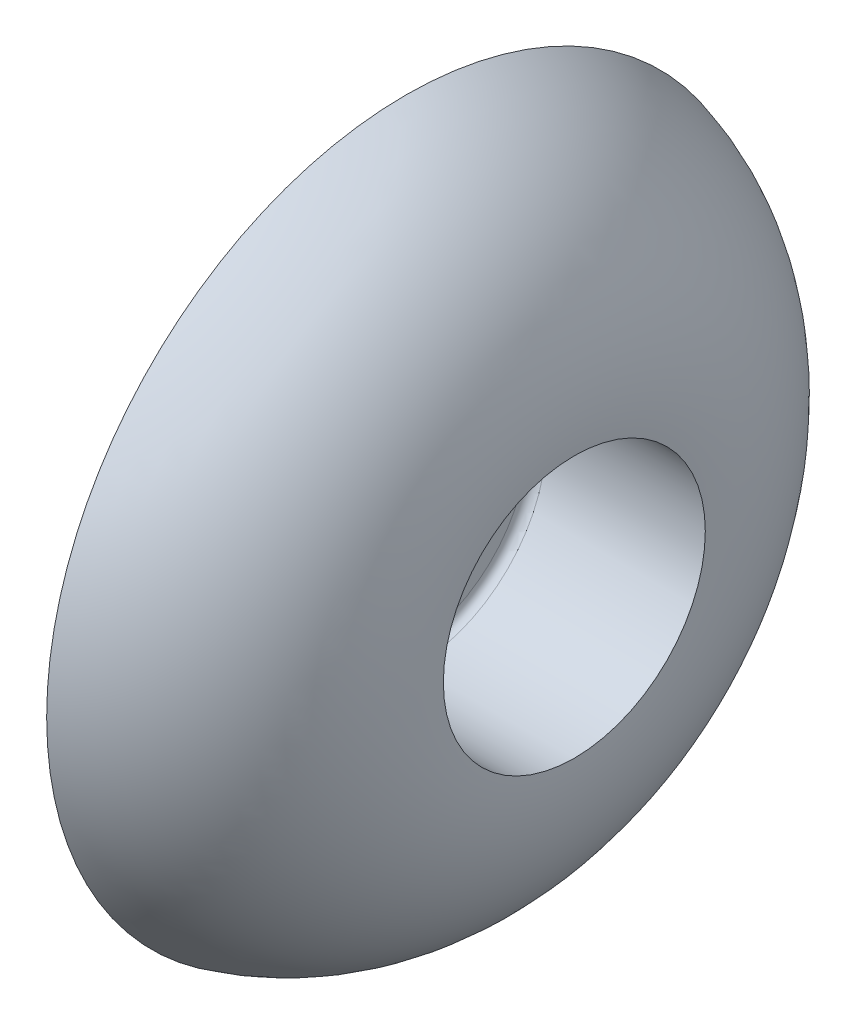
ISO-10303-21;
HEADER;
FILE_DESCRIPTION(('STEP AP214'),'2;1');
FILE_NAME('part.step','',(''),(''),'','','');
FILE_SCHEMA(('AUTOMOTIVE_DESIGN { 1 0 10303 214 1 1 1 1 }'));
ENDSEC;
DATA;
#1=APPLICATION_CONTEXT('core data for automotive mechanical design processes');
#2=APPLICATION_PROTOCOL_DEFINITION('international standard','automotive_design',2000,#1);
#3=PRODUCT_CONTEXT('',#1,'mechanical');
#4=PRODUCT('Part','Part','',(#3));
#5=PRODUCT_RELATED_PRODUCT_CATEGORY('part','',(#4));
#6=PRODUCT_DEFINITION_FORMATION('','',#4);
#7=PRODUCT_DEFINITION_CONTEXT('part definition',#1,'design');
#8=PRODUCT_DEFINITION('design','',#6,#7);
#9=PRODUCT_DEFINITION_SHAPE('','',#8);
#10=(LENGTH_UNIT() NAMED_UNIT(*) SI_UNIT(.MILLI.,.METRE.));
#11=(NAMED_UNIT(*) PLANE_ANGLE_UNIT() SI_UNIT($,.RADIAN.));
#12=(NAMED_UNIT(*) SI_UNIT($,.STERADIAN.) SOLID_ANGLE_UNIT());
#13=UNCERTAINTY_MEASURE_WITH_UNIT(LENGTH_MEASURE(1.E-05),#10,'distance_accuracy_value','');
#14=(GEOMETRIC_REPRESENTATION_CONTEXT(3) GLOBAL_UNCERTAINTY_ASSIGNED_CONTEXT((#13)) GLOBAL_UNIT_ASSIGNED_CONTEXT((#10,
#11,#12)) REPRESENTATION_CONTEXT('',''));
#15=CARTESIAN_POINT('',(0.,0.,0.));
#16=DIRECTION('',(0.,0.,1.));
#17=DIRECTION('',(1.,0.,0.));
#18=AXIS2_PLACEMENT_3D('',#15,#16,#17);
#19=CARTESIAN_POINT('',(12.4321690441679,6.99999999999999,0.));
#20=DIRECTION('',(-1.,0.,0.));
#21=DIRECTION('',(0.,0.,1.));
#22=AXIS2_PLACEMENT_3D('',#19,#20,#21);
#23=PLANE('',#22);
#24=CARTESIAN_POINT('',(12.4321690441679,0.,0.));
#25=DIRECTION('',(-1.,0.,0.));
#26=DIRECTION('',(0.,0.,1.));
#27=AXIS2_PLACEMENT_3D('',#24,#25,#26);
#28=CIRCLE('',#27,5.99999999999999);
#29=CARTESIAN_POINT('',(12.4321690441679,0.,5.99999999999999));
#30=VERTEX_POINT('',#29);
#31=EDGE_CURVE('E55',#30,#30,#28,.T.);
#32=ORIENTED_EDGE('',*,*,#31,.T.);
#33=EDGE_LOOP('',(#32));
#34=FACE_BOUND('',#33,.T.);
#35=CARTESIAN_POINT('',(12.4321690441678,0.,0.));
#36=DIRECTION('',(1.,0.,0.));
#37=DIRECTION('',(0.,0.,-1.));
#38=AXIS2_PLACEMENT_3D('',#35,#36,#37);
#39=CIRCLE('',#38,4.49999999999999);
#40=CARTESIAN_POINT('',(12.4321690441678,0.,-4.49999999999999));
#41=VERTEX_POINT('',#40);
#42=EDGE_CURVE('E70',#41,#41,#39,.T.);
#43=ORIENTED_EDGE('',*,*,#42,.T.);
#44=EDGE_LOOP('',(#43));
#45=FACE_BOUND('',#44,.T.);
#46=ADVANCED_FACE('F27',(#34,#45),#23,.T.);
#47=CARTESIAN_POINT('',(60.,0.,0.));
#48=DIRECTION('',(1.,0.,0.));
#49=DIRECTION('',(0.,0.,-1.));
#50=AXIS2_PLACEMENT_3D('',#47,#48,#49);
#51=CYLINDRICAL_SURFACE('',#50,9.5);
#52=CARTESIAN_POINT('',(15.9321690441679,0.,0.));
#53=DIRECTION('',(-1.,0.,0.));
#54=DIRECTION('',(0.,0.,1.));
#55=AXIS2_PLACEMENT_3D('',#52,#53,#54);
#56=CIRCLE('',#55,9.5);
#57=CARTESIAN_POINT('',(15.9321690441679,0.,9.5));
#58=VERTEX_POINT('',#57);
#59=EDGE_CURVE('E49',#58,#58,#56,.F.);
#60=ORIENTED_EDGE('',*,*,#59,.T.);
#61=EDGE_LOOP('',(#60));
#62=FACE_BOUND('',#61,.T.);
#63=CARTESIAN_POINT('',(22.4278518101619,0.,0.));
#64=DIRECTION('',(1.,0.,0.));
#65=DIRECTION('',(0.,0.,-1.));
#66=AXIS2_PLACEMENT_3D('',#63,#64,#65);
#67=CIRCLE('',#66,9.5);
#68=CARTESIAN_POINT('',(22.4278518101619,0.,-9.5));
#69=VERTEX_POINT('',#68);
#70=EDGE_CURVE('E52',#69,#69,#67,.F.);
#71=ORIENTED_EDGE('',*,*,#70,.T.);
#72=EDGE_LOOP('',(#71));
#73=FACE_BOUND('',#72,.T.);
#74=ADVANCED_FACE('F91',(#62,#73),#51,.T.);
#75=CARTESIAN_POINT('',(14.4460717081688,0.,0.));
#76=DIRECTION('',(1.,0.,0.));
#77=DIRECTION('',(0.,0.,-1.));
#78=AXIS2_PLACEMENT_3D('',#75,#76,#77);
#79=DEGENERATE_TOROIDAL_SURFACE('',#78,7.57746917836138,9.5,.T.);
#80=CARTESIAN_POINT('',(23.3668847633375,0.,0.));
#81=DIRECTION('',(-1.,0.,0.));
#82=DIRECTION('',(0.,0.,1.));
#83=AXIS2_PLACEMENT_3D('',#80,#81,#82);
#84=CIRCLE('',#83,10.8438271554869);
#85=CARTESIAN_POINT('',(23.3668847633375,0.,10.8438271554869));
#86=VERTEX_POINT('',#85);
#87=EDGE_CURVE('E46',#86,#86,#84,.F.);
#88=ORIENTED_EDGE('',*,*,#87,.T.);
#89=EDGE_LOOP('',(#88));
#90=FACE_BOUND('',#89,.T.);
#91=CARTESIAN_POINT('',(17.4321690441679,0.,0.));
#92=DIRECTION('',(1.,0.,0.));
#93=DIRECTION('',(0.,0.,-1.));
#94=AXIS2_PLACEMENT_3D('',#91,#92,#93);
#95=CIRCLE('',#94,16.5959625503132);
#96=CARTESIAN_POINT('',(17.4321690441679,0.,-16.5959625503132));
#97=VERTEX_POINT('',#96);
#98=EDGE_CURVE('E58',#97,#97,#95,.T.);
#99=ORIENTED_EDGE('',*,*,#98,.F.);
#100=EDGE_LOOP('',(#99));
#101=FACE_BOUND('',#100,.T.);
#102=ADVANCED_FACE('F96',(#90,#101),#79,.F.);
#103=CARTESIAN_POINT('',(17.4321690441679,19.2,0.));
#104=DIRECTION('',(-1.,0.,0.));
#105=DIRECTION('',(0.,0.,1.));
#106=AXIS2_PLACEMENT_3D('',#103,#104,#105);
#107=PLANE('',#106);
#108=ORIENTED_EDGE('',*,*,#98,.T.);
#109=EDGE_LOOP('',(#108));
#110=FACE_BOUND('',#109,.T.);
#111=CARTESIAN_POINT('',(17.4321690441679,0.,0.));
#112=DIRECTION('',(1.,0.,0.));
#113=DIRECTION('',(0.,0.,-1.));
#114=AXIS2_PLACEMENT_3D('',#111,#112,#113);
#115=CIRCLE('',#114,19.2);
#116=CARTESIAN_POINT('',(17.4321690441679,0.,-19.2));
#117=VERTEX_POINT('',#116);
#118=EDGE_CURVE('E61',#117,#117,#115,.T.);
#119=ORIENTED_EDGE('',*,*,#118,.F.);
#120=EDGE_LOOP('',(#119));
#121=FACE_BOUND('',#120,.T.);
#122=ADVANCED_FACE('F103',(#110,#121),#107,.T.);
#123=CARTESIAN_POINT('',(14.4460717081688,0.,0.));
#124=DIRECTION('',(1.,0.,0.));
#125=DIRECTION('',(0.,0.,-1.));
#126=AXIS2_PLACEMENT_3D('',#123,#124,#125);
#127=DEGENERATE_TOROIDAL_SURFACE('',#126,7.57746917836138,12.,.T.);
#128=ORIENTED_EDGE('',*,*,#118,.T.);
#129=EDGE_LOOP('',(#128));
#130=FACE_BOUND('',#129,.T.);
#131=CARTESIAN_POINT('',(26.4321690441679,0.,0.));
#132=DIRECTION('',(1.,0.,0.));
#133=DIRECTION('',(0.,0.,-1.));
#134=AXIS2_PLACEMENT_3D('',#131,#132,#133);
#135=CIRCLE('',#134,7.);
#136=CARTESIAN_POINT('',(26.4321690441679,0.,-7.));
#137=VERTEX_POINT('',#136);
#138=EDGE_CURVE('E64',#137,#137,#135,.T.);
#139=ORIENTED_EDGE('',*,*,#138,.F.);
#140=EDGE_LOOP('',(#139));
#141=FACE_BOUND('',#140,.T.);
#142=ADVANCED_FACE('F110',(#130,#141),#127,.T.);
#143=CARTESIAN_POINT('',(60.,0.,0.));
#144=DIRECTION('',(1.,0.,0.));
#145=DIRECTION('',(0.,0.,-1.));
#146=AXIS2_PLACEMENT_3D('',#143,#144,#145);
#147=CYLINDRICAL_SURFACE('',#146,7.);
#148=CARTESIAN_POINT('',(17.9321690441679,0.,0.));
#149=DIRECTION('',(1.,0.,0.));
#150=DIRECTION('',(0.,0.,-1.));
#151=AXIS2_PLACEMENT_3D('',#148,#149,#150);
#152=CIRCLE('',#151,7.);
#153=CARTESIAN_POINT('',(17.9321690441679,0.,-7.));
#154=VERTEX_POINT('',#153);
#155=EDGE_CURVE('E10',#154,#154,#152,.F.);
#156=ORIENTED_EDGE('',*,*,#155,.T.);
#157=EDGE_LOOP('',(#156));
#158=FACE_BOUND('',#157,.T.);
#159=ORIENTED_EDGE('',*,*,#138,.T.);
#160=EDGE_LOOP('',(#159));
#161=FACE_BOUND('',#160,.T.);
#162=ADVANCED_FACE('F88',(#158,#161),#147,.F.);
#163=CARTESIAN_POINT('',(17.4321690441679,4.49999999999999,0.));
#164=DIRECTION('',(1.,0.,0.));
#165=DIRECTION('',(0.,0.,-1.));
#166=AXIS2_PLACEMENT_3D('',#163,#164,#165);
#167=PLANE('',#166);
#168=CARTESIAN_POINT('',(17.4321690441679,0.,0.));
#169=DIRECTION('',(1.,0.,0.));
#170=DIRECTION('',(0.,0.,-1.));
#171=AXIS2_PLACEMENT_3D('',#168,#169,#170);
#172=CIRCLE('',#171,6.5);
#173=CARTESIAN_POINT('',(17.4321690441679,0.,-6.5));
#174=VERTEX_POINT('',#173);
#175=EDGE_CURVE('E33',#174,#174,#172,.T.);
#176=ORIENTED_EDGE('',*,*,#175,.T.);
#177=EDGE_LOOP('',(#176));
#178=FACE_BOUND('',#177,.T.);
#179=CARTESIAN_POINT('',(17.4321690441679,0.,0.));
#180=DIRECTION('',(1.,0.,0.));
#181=DIRECTION('',(0.,0.,-1.));
#182=AXIS2_PLACEMENT_3D('',#179,#180,#181);
#183=CIRCLE('',#182,4.49999999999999);
#184=CARTESIAN_POINT('',(17.4321690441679,0.,-4.49999999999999));
#185=VERTEX_POINT('',#184);
#186=EDGE_CURVE('E67',#185,#185,#183,.T.);
#187=ORIENTED_EDGE('',*,*,#186,.F.);
#188=EDGE_LOOP('',(#187));
#189=FACE_BOUND('',#188,.T.);
#190=ADVANCED_FACE('F78',(#178,#189),#167,.T.);
#191=CARTESIAN_POINT('',(60.,0.,0.));
#192=DIRECTION('',(1.,0.,0.));
#193=DIRECTION('',(0.,0.,-1.));
#194=AXIS2_PLACEMENT_3D('',#191,#192,#193);
#195=CYLINDRICAL_SURFACE('',#194,4.49999999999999);
#196=ORIENTED_EDGE('',*,*,#186,.T.);
#197=EDGE_LOOP('',(#196));
#198=FACE_BOUND('',#197,.T.);
#199=ORIENTED_EDGE('',*,*,#42,.F.);
#200=EDGE_LOOP('',(#199));
#201=FACE_BOUND('',#200,.T.);
#202=ADVANCED_FACE('F75',(#198,#201),#195,.F.);
#203=CARTESIAN_POINT('',(13.4321690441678,0.,0.));
#204=DIRECTION('',(-1.,0.,0.));
#205=DIRECTION('',(0.,0.,1.));
#206=AXIS2_PLACEMENT_3D('',#203,#204,#205);
#207=TOROIDAL_SURFACE('',#206,5.99999999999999,1.);
#208=CARTESIAN_POINT('',(13.2775311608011,0.,0.));
#209=DIRECTION('',(1.,0.,0.));
#210=DIRECTION('',(0.,0.,-1.));
#211=AXIS2_PLACEMENT_3D('',#208,#209,#210);
#212=CIRCLE('',#211,6.98797121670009);
#213=CARTESIAN_POINT('',(13.2775311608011,0.,-6.98797121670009));
#214=VERTEX_POINT('',#213);
#215=EDGE_CURVE('E37',#214,#214,#212,.F.);
#216=ORIENTED_EDGE('',*,*,#215,.T.);
#217=EDGE_LOOP('',(#216));
#218=FACE_BOUND('',#217,.T.);
#219=ORIENTED_EDGE('',*,*,#31,.F.);
#220=EDGE_LOOP('',(#219));
#221=FACE_BOUND('',#220,.T.);
#222=ADVANCED_FACE('F77',(#218,#221),#207,.T.);
#223=CARTESIAN_POINT('',(15.9321690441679,0.,0.));
#224=DIRECTION('',(-1.,0.,0.));
#225=DIRECTION('',(0.,0.,1.));
#226=AXIS2_PLACEMENT_3D('',#223,#224,#225);
#227=TOROIDAL_SURFACE('',#226,8.5,1.);
#228=CARTESIAN_POINT('',(14.9441978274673,0.,0.));
#229=DIRECTION('',(1.,0.,0.));
#230=DIRECTION('',(0.,0.,-1.));
#231=AXIS2_PLACEMENT_3D('',#228,#229,#230);
#232=CIRCLE('',#231,8.65463788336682);
#233=CARTESIAN_POINT('',(14.9441978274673,0.,-8.65463788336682));
#234=VERTEX_POINT('',#233);
#235=EDGE_CURVE('E41',#234,#234,#232,.T.);
#236=ORIENTED_EDGE('',*,*,#235,.T.);
#237=EDGE_LOOP('',(#236));
#238=FACE_BOUND('',#237,.T.);
#239=ORIENTED_EDGE('',*,*,#59,.F.);
#240=EDGE_LOOP('',(#239));
#241=FACE_BOUND('',#240,.T.);
#242=ADVANCED_FACE('F85',(#238,#241),#227,.T.);
#243=CARTESIAN_POINT('',(22.4278518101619,0.,0.));
#244=DIRECTION('',(1.,0.,0.));
#245=DIRECTION('',(0.,0.,-1.));
#246=AXIS2_PLACEMENT_3D('',#243,#244,#245);
#247=TOROIDAL_SURFACE('',#246,10.5,1.);
#248=ORIENTED_EDGE('',*,*,#70,.F.);
#249=EDGE_LOOP('',(#248));
#250=FACE_BOUND('',#249,.T.);
#251=ORIENTED_EDGE('',*,*,#87,.F.);
#252=EDGE_LOOP('',(#251));
#253=FACE_BOUND('',#252,.T.);
#254=ADVANCED_FACE('F146',(#250,#253),#247,.F.);
#255=CARTESIAN_POINT('',(12.9682553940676,0.,0.));
#256=DIRECTION('',(1.,0.,0.));
#257=DIRECTION('',(0.,0.,-1.));
#258=AXIS2_PLACEMENT_3D('',#255,#256,#257);
#259=TOROIDAL_SURFACE('',#258,8.96391365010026,2.);
#260=ORIENTED_EDGE('',*,*,#215,.F.);
#261=EDGE_LOOP('',(#260));
#262=FACE_BOUND('',#261,.T.);
#263=ORIENTED_EDGE('',*,*,#235,.F.);
#264=EDGE_LOOP('',(#263));
#265=FACE_BOUND('',#264,.T.);
#266=ADVANCED_FACE('F156',(#262,#265),#259,.F.);
#267=CARTESIAN_POINT('',(17.9321690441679,0.,0.));
#268=DIRECTION('',(1.,0.,0.));
#269=DIRECTION('',(0.,0.,-1.));
#270=AXIS2_PLACEMENT_3D('',#267,#268,#269);
#271=TOROIDAL_SURFACE('',#270,6.5,0.5);
#272=ORIENTED_EDGE('',*,*,#155,.F.);
#273=EDGE_LOOP('',(#272));
#274=FACE_BOUND('',#273,.T.);
#275=ORIENTED_EDGE('',*,*,#175,.F.);
#276=EDGE_LOOP('',(#275));
#277=FACE_BOUND('',#276,.T.);
#278=ADVANCED_FACE('F166',(#274,#277),#271,.F.);
#279=CLOSED_SHELL('',(#46,#74,#102,#122,#142,#162,#190,#202,#222,#242,#254,#266,#278));
#280=MANIFOLD_SOLID_BREP('B2',#279);
#281=ADVANCED_BREP_SHAPE_REPRESENTATION('',(#18,#280),#14);
#282=SHAPE_DEFINITION_REPRESENTATION(#9,#281);
ENDSEC;
END-ISO-10303-21;
